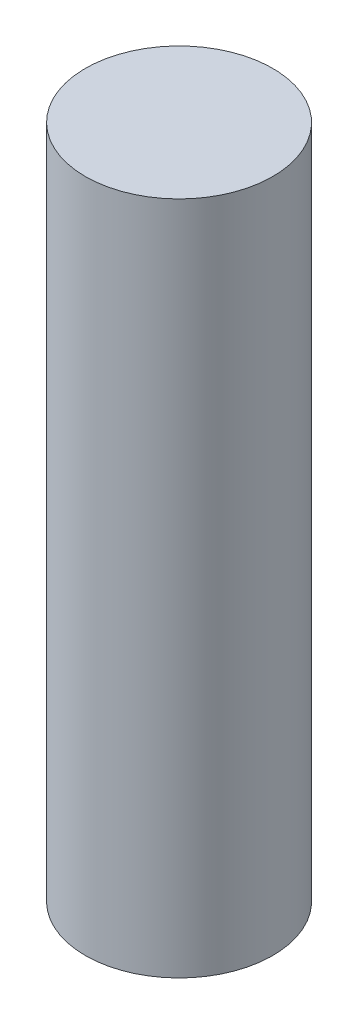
ISO-10303-21;
HEADER;
FILE_DESCRIPTION(('STEP AP214'),'2;1');
FILE_NAME('part.step','',(''),(''),'','','');
FILE_SCHEMA(('AUTOMOTIVE_DESIGN { 1 0 10303 214 1 1 1 1 }'));
ENDSEC;
DATA;
#1=APPLICATION_CONTEXT('core data for automotive mechanical design processes');
#2=APPLICATION_PROTOCOL_DEFINITION('international standard','automotive_design',2000,#1);
#3=PRODUCT_CONTEXT('',#1,'mechanical');
#4=PRODUCT('Part','Part','',(#3));
#5=PRODUCT_RELATED_PRODUCT_CATEGORY('part','',(#4));
#6=PRODUCT_DEFINITION_FORMATION('','',#4);
#7=PRODUCT_DEFINITION_CONTEXT('part definition',#1,'design');
#8=PRODUCT_DEFINITION('design','',#6,#7);
#9=PRODUCT_DEFINITION_SHAPE('','',#8);
#10=(LENGTH_UNIT() NAMED_UNIT(*) SI_UNIT(.MILLI.,.METRE.));
#11=(NAMED_UNIT(*) PLANE_ANGLE_UNIT() SI_UNIT($,.RADIAN.));
#12=(NAMED_UNIT(*) SI_UNIT($,.STERADIAN.) SOLID_ANGLE_UNIT());
#13=UNCERTAINTY_MEASURE_WITH_UNIT(LENGTH_MEASURE(1.E-05),#10,'distance_accuracy_value','');
#14=(GEOMETRIC_REPRESENTATION_CONTEXT(3) GLOBAL_UNCERTAINTY_ASSIGNED_CONTEXT((#13)) GLOBAL_UNIT_ASSIGNED_CONTEXT((#10,
#11,#12)) REPRESENTATION_CONTEXT('',''));
#15=CARTESIAN_POINT('',(0.,0.,0.));
#16=DIRECTION('',(0.,0.,1.));
#17=DIRECTION('',(1.,0.,0.));
#18=AXIS2_PLACEMENT_3D('',#15,#16,#17);
#19=CARTESIAN_POINT('',(0.,7.2,0.));
#20=DIRECTION('',(0.,1.,0.));
#21=DIRECTION('',(0.,0.,1.));
#22=AXIS2_PLACEMENT_3D('',#19,#20,#21);
#23=PLANE('',#22);
#24=CARTESIAN_POINT('',(0.,7.2,0.));
#25=DIRECTION('',(0.,1.,0.));
#26=DIRECTION('',(0.,0.,1.));
#27=AXIS2_PLACEMENT_3D('',#24,#25,#26);
#28=CIRCLE('',#27,1.);
#29=CARTESIAN_POINT('',(0.,7.2,1.));
#30=VERTEX_POINT('',#29);
#31=EDGE_CURVE('E17',#30,#30,#28,.F.);
#32=ORIENTED_EDGE('',*,*,#31,.F.);
#33=EDGE_LOOP('',(#32));
#34=FACE_BOUND('',#33,.T.);
#35=ADVANCED_FACE('F14',(#34),#23,.T.);
#36=CARTESIAN_POINT('',(0.,0.,0.));
#37=DIRECTION('',(0.,1.,0.));
#38=DIRECTION('',(0.,0.,1.));
#39=AXIS2_PLACEMENT_3D('',#36,#37,#38);
#40=PLANE('',#39);
#41=CARTESIAN_POINT('',(0.,0.,0.));
#42=DIRECTION('',(0.,1.,0.));
#43=DIRECTION('',(0.,0.,1.));
#44=AXIS2_PLACEMENT_3D('',#41,#42,#43);
#45=CIRCLE('',#44,1.);
#46=CARTESIAN_POINT('',(0.,0.,1.));
#47=VERTEX_POINT('',#46);
#48=EDGE_CURVE('E10',#47,#47,#45,.T.);
#49=ORIENTED_EDGE('',*,*,#48,.F.);
#50=EDGE_LOOP('',(#49));
#51=FACE_BOUND('',#50,.T.);
#52=ADVANCED_FACE('F29',(#51),#40,.F.);
#53=CARTESIAN_POINT('',(0.,0.,0.));
#54=DIRECTION('',(0.,1.,0.));
#55=DIRECTION('',(0.,0.,1.));
#56=AXIS2_PLACEMENT_3D('',#53,#54,#55);
#57=CYLINDRICAL_SURFACE('',#56,1.);
#58=ORIENTED_EDGE('',*,*,#31,.T.);
#59=EDGE_LOOP('',(#58));
#60=FACE_BOUND('',#59,.T.);
#61=ORIENTED_EDGE('',*,*,#48,.T.);
#62=EDGE_LOOP('',(#61));
#63=FACE_BOUND('',#62,.T.);
#64=ADVANCED_FACE('F26',(#60,#63),#57,.T.);
#65=CLOSED_SHELL('',(#35,#52,#64));
#66=MANIFOLD_SOLID_BREP('B1',#65);
#67=ADVANCED_BREP_SHAPE_REPRESENTATION('',(#18,#66),#14);
#68=SHAPE_DEFINITION_REPRESENTATION(#9,#67);
ENDSEC;
END-ISO-10303-21;
